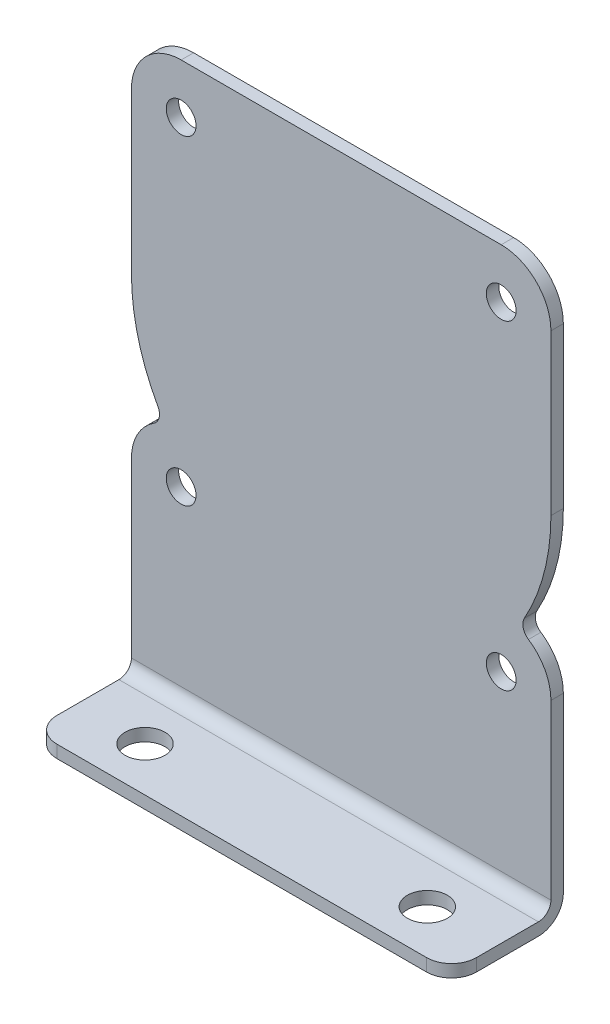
ISO-10303-21;
HEADER;
FILE_DESCRIPTION(('STEP AP214'),'2;1');
FILE_NAME('part.step','',(''),(''),'','','');
FILE_SCHEMA(('AUTOMOTIVE_DESIGN { 1 0 10303 214 1 1 1 1 }'));
ENDSEC;
DATA;
#1=APPLICATION_CONTEXT('core data for automotive mechanical design processes');
#2=APPLICATION_PROTOCOL_DEFINITION('international standard','automotive_design',2000,#1);
#3=PRODUCT_CONTEXT('',#1,'mechanical');
#4=PRODUCT('Part','Part','',(#3));
#5=PRODUCT_RELATED_PRODUCT_CATEGORY('part','',(#4));
#6=PRODUCT_DEFINITION_FORMATION('','',#4);
#7=PRODUCT_DEFINITION_CONTEXT('part definition',#1,'design');
#8=PRODUCT_DEFINITION('design','',#6,#7);
#9=PRODUCT_DEFINITION_SHAPE('','',#8);
#10=(LENGTH_UNIT() NAMED_UNIT(*) SI_UNIT(.MILLI.,.METRE.));
#11=(NAMED_UNIT(*) PLANE_ANGLE_UNIT() SI_UNIT($,.RADIAN.));
#12=(NAMED_UNIT(*) SI_UNIT($,.STERADIAN.) SOLID_ANGLE_UNIT());
#13=UNCERTAINTY_MEASURE_WITH_UNIT(LENGTH_MEASURE(1.E-05),#10,'distance_accuracy_value','');
#14=(GEOMETRIC_REPRESENTATION_CONTEXT(3) GLOBAL_UNCERTAINTY_ASSIGNED_CONTEXT((#13)) GLOBAL_UNIT_ASSIGNED_CONTEXT((#10,
#11,#12)) REPRESENTATION_CONTEXT('',''));
#15=CARTESIAN_POINT('',(0.,0.,0.));
#16=DIRECTION('',(0.,0.,1.));
#17=DIRECTION('',(1.,0.,0.));
#18=AXIS2_PLACEMENT_3D('',#15,#16,#17);
#19=CARTESIAN_POINT('',(23.622,-4.12115,11.1125));
#20=DIRECTION('',(0.,-1.,0.));
#21=DIRECTION('',(0.,0.,-1.));
#22=AXIS2_PLACEMENT_3D('',#19,#20,#21);
#23=CYLINDRICAL_SURFACE('',#22,3.175);
#24=CARTESIAN_POINT('',(23.622,-39.1922,11.1125));
#25=DIRECTION('',(0.,-1.,0.));
#26=DIRECTION('',(0.,0.,-1.));
#27=AXIS2_PLACEMENT_3D('',#24,#25,#26);
#28=CIRCLE('',#27,3.175);
#29=CARTESIAN_POINT('',(23.622,-39.1922,14.2875));
#30=VERTEX_POINT('',#29);
#31=CARTESIAN_POINT('',(26.797,-39.1922,11.1125));
#32=VERTEX_POINT('',#31);
#33=EDGE_CURVE('E19',#30,#32,#28,.F.);
#34=ORIENTED_EDGE('',*,*,#33,.F.);
#35=DIRECTION('',(0.,1.,0.));
#36=VECTOR('',#35,1.);
#37=CARTESIAN_POINT('',(23.622,-39.9923,14.2875));
#38=LINE('',#37,#36);
#39=CARTESIAN_POINT('',(23.622,-40.7924,14.2875));
#40=VERTEX_POINT('',#39);
#41=EDGE_CURVE('E114',#40,#30,#38,.T.);
#42=ORIENTED_EDGE('',*,*,#41,.F.);
#43=CARTESIAN_POINT('',(23.622,-40.7924,11.1125));
#44=DIRECTION('',(0.,-1.,0.));
#45=DIRECTION('',(0.,0.,-1.));
#46=AXIS2_PLACEMENT_3D('',#43,#44,#45);
#47=CIRCLE('',#46,3.175);
#48=CARTESIAN_POINT('',(26.797,-40.7924,11.1125));
#49=VERTEX_POINT('',#48);
#50=EDGE_CURVE('E250',#49,#40,#47,.T.);
#51=ORIENTED_EDGE('',*,*,#50,.F.);
#52=DIRECTION('',(0.,-1.,0.));
#53=VECTOR('',#52,1.);
#54=CARTESIAN_POINT('',(26.797,-4.12115,11.1125));
#55=LINE('',#54,#53);
#56=EDGE_CURVE('E124',#49,#32,#55,.F.);
#57=ORIENTED_EDGE('',*,*,#56,.T.);
#58=EDGE_LOOP('',(#34,#42,#51,#57));
#59=FACE_BOUND('',#58,.T.);
#60=ADVANCED_FACE('F16',(#59),#23,.T.);
#61=CARTESIAN_POINT('',(0.,-39.9923,14.2875));
#62=DIRECTION('',(0.,0.,1.));
#63=DIRECTION('',(1.,0.,0.));
#64=AXIS2_PLACEMENT_3D('',#61,#62,#63);
#65=PLANE('',#64);
#66=DIRECTION('',(0.,1.,0.));
#67=VECTOR('',#66,1.);
#68=CARTESIAN_POINT('',(-23.622,-35.87115,14.2875));
#69=LINE('',#68,#67);
#70=CARTESIAN_POINT('',(-23.622,-40.7924,14.2875));
#71=VERTEX_POINT('',#70);
#72=CARTESIAN_POINT('',(-23.622,-39.1922,14.2875));
#73=VERTEX_POINT('',#72);
#74=EDGE_CURVE('E138',#71,#73,#69,.T.);
#75=ORIENTED_EDGE('',*,*,#74,.F.);
#76=DIRECTION('',(1.,0.,0.));
#77=VECTOR('',#76,1.);
#78=CARTESIAN_POINT('',(-26.797,-40.7924,14.2875));
#79=LINE('',#78,#77);
#80=EDGE_CURVE('E119',#40,#71,#79,.F.);
#81=ORIENTED_EDGE('',*,*,#80,.F.);
#82=ORIENTED_EDGE('',*,*,#41,.T.);
#83=DIRECTION('',(1.,0.,0.));
#84=VECTOR('',#83,1.);
#85=CARTESIAN_POINT('',(-26.797,-39.1922,14.2875));
#86=LINE('',#85,#84);
#87=EDGE_CURVE('E118',#73,#30,#86,.T.);
#88=ORIENTED_EDGE('',*,*,#87,.F.);
#89=EDGE_LOOP('',(#75,#81,#82,#88));
#90=FACE_BOUND('',#89,.T.);
#91=ADVANCED_FACE('F117',(#90),#65,.T.);
#92=CARTESIAN_POINT('',(-23.622,-35.87115,11.1125));
#93=DIRECTION('',(0.,1.,0.));
#94=DIRECTION('',(0.,0.,1.));
#95=AXIS2_PLACEMENT_3D('',#92,#93,#94);
#96=CYLINDRICAL_SURFACE('',#95,3.175);
#97=CARTESIAN_POINT('',(-23.622,-40.7924,11.1125));
#98=DIRECTION('',(0.,1.,0.));
#99=DIRECTION('',(0.,0.,1.));
#100=AXIS2_PLACEMENT_3D('',#97,#98,#99);
#101=CIRCLE('',#100,3.175);
#102=CARTESIAN_POINT('',(-26.797,-40.7924,11.1125));
#103=VERTEX_POINT('',#102);
#104=EDGE_CURVE('E247',#71,#103,#101,.F.);
#105=ORIENTED_EDGE('',*,*,#104,.F.);
#106=ORIENTED_EDGE('',*,*,#74,.T.);
#107=CARTESIAN_POINT('',(-23.622,-39.1922,11.1125));
#108=DIRECTION('',(0.,1.,0.));
#109=DIRECTION('',(0.,0.,1.));
#110=AXIS2_PLACEMENT_3D('',#107,#108,#109);
#111=CIRCLE('',#110,3.175);
#112=CARTESIAN_POINT('',(-26.797,-39.1922,11.1125));
#113=VERTEX_POINT('',#112);
#114=EDGE_CURVE('E134',#113,#73,#111,.T.);
#115=ORIENTED_EDGE('',*,*,#114,.F.);
#116=DIRECTION('',(0.,1.,0.));
#117=VECTOR('',#116,1.);
#118=CARTESIAN_POINT('',(-26.797,-35.87115,11.1125));
#119=LINE('',#118,#117);
#120=EDGE_CURVE('E123',#113,#103,#119,.F.);
#121=ORIENTED_EDGE('',*,*,#120,.T.);
#122=EDGE_LOOP('',(#105,#106,#115,#121));
#123=FACE_BOUND('',#122,.T.);
#124=ADVANCED_FACE('F264',(#123),#96,.T.);
#125=CARTESIAN_POINT('',(-18.034,-130.509500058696,8.61414178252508));
#126=DIRECTION('',(0.,-1.,0.));
#127=DIRECTION('',(0.,0.,-1.));
#128=AXIS2_PLACEMENT_3D('',#125,#126,#127);
#129=CYLINDRICAL_SURFACE('',#128,2.5527);
#130=CARTESIAN_POINT('',(-18.034,-39.1922,8.61414178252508));
#131=DIRECTION('',(0.,-1.,0.));
#132=DIRECTION('',(0.,0.,-1.));
#133=AXIS2_PLACEMENT_3D('',#130,#131,#132);
#134=CIRCLE('',#133,2.5527);
#135=CARTESIAN_POINT('',(-18.034,-39.1922,6.06144178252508));
#136=VERTEX_POINT('',#135);
#137=EDGE_CURVE('E135',#136,#136,#134,.T.);
#138=ORIENTED_EDGE('',*,*,#137,.F.);
#139=EDGE_LOOP('',(#138));
#140=FACE_BOUND('',#139,.T.);
#141=CARTESIAN_POINT('',(-18.034,-40.7924,8.61414178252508));
#142=DIRECTION('',(0.,-1.,0.));
#143=DIRECTION('',(0.,0.,-1.));
#144=AXIS2_PLACEMENT_3D('',#141,#142,#143);
#145=CIRCLE('',#144,2.5527);
#146=CARTESIAN_POINT('',(-18.034,-40.7924,6.06144178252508));
#147=VERTEX_POINT('',#146);
#148=EDGE_CURVE('E244',#147,#147,#145,.F.);
#149=ORIENTED_EDGE('',*,*,#148,.F.);
#150=EDGE_LOOP('',(#149));
#151=FACE_BOUND('',#150,.T.);
#152=ADVANCED_FACE('F260',(#140,#151),#129,.F.);
#153=CARTESIAN_POINT('',(18.034,-130.509500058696,8.61414178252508));
#154=DIRECTION('',(0.,1.,0.));
#155=DIRECTION('',(0.,0.,1.));
#156=AXIS2_PLACEMENT_3D('',#153,#154,#155);
#157=CYLINDRICAL_SURFACE('',#156,2.5527);
#158=CARTESIAN_POINT('',(18.034,-39.1922,8.61414178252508));
#159=DIRECTION('',(0.,1.,0.));
#160=DIRECTION('',(0.,0.,1.));
#161=AXIS2_PLACEMENT_3D('',#158,#159,#160);
#162=CIRCLE('',#161,2.5527);
#163=CARTESIAN_POINT('',(18.034,-39.1922,11.1668417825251));
#164=VERTEX_POINT('',#163);
#165=EDGE_CURVE('E253',#164,#164,#162,.F.);
#166=ORIENTED_EDGE('',*,*,#165,.F.);
#167=EDGE_LOOP('',(#166));
#168=FACE_BOUND('',#167,.T.);
#169=CARTESIAN_POINT('',(18.034,-40.7924,8.61414178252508));
#170=DIRECTION('',(0.,1.,0.));
#171=DIRECTION('',(0.,0.,1.));
#172=AXIS2_PLACEMENT_3D('',#169,#170,#171);
#173=CIRCLE('',#172,2.5527);
#174=CARTESIAN_POINT('',(18.034,-40.7924,11.1668417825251));
#175=VERTEX_POINT('',#174);
#176=EDGE_CURVE('E240',#175,#175,#173,.T.);
#177=ORIENTED_EDGE('',*,*,#176,.F.);
#178=EDGE_LOOP('',(#177));
#179=FACE_BOUND('',#178,.T.);
#180=ADVANCED_FACE('F263',(#168,#179),#157,.F.);
#181=CARTESIAN_POINT('',(-26.797,-39.1922,1.5875));
#182=DIRECTION('',(0.,1.,0.));
#183=DIRECTION('',(0.,0.,1.));
#184=AXIS2_PLACEMENT_3D('',#181,#182,#183);
#185=PLANE('',#184);
#186=ORIENTED_EDGE('',*,*,#165,.T.);
#187=EDGE_LOOP('',(#186));
#188=FACE_BOUND('',#187,.T.);
#189=ORIENTED_EDGE('',*,*,#137,.T.);
#190=EDGE_LOOP('',(#189));
#191=FACE_BOUND('',#190,.T.);
#192=ORIENTED_EDGE('',*,*,#114,.T.);
#193=ORIENTED_EDGE('',*,*,#87,.T.);
#194=ORIENTED_EDGE('',*,*,#33,.T.);
#195=DIRECTION('',(0.,0.,-1.));
#196=VECTOR('',#195,1.);
#197=CARTESIAN_POINT('',(26.797,-39.1922,0.));
#198=LINE('',#197,#196);
#199=CARTESIAN_POINT('',(26.797,-39.1922,3.1877));
#200=VERTEX_POINT('',#199);
#201=EDGE_CURVE('E235',#200,#32,#198,.F.);
#202=ORIENTED_EDGE('',*,*,#201,.F.);
#203=DIRECTION('',(1.,0.,0.));
#204=VECTOR('',#203,1.);
#205=CARTESIAN_POINT('',(-13.3985,-39.1922,3.1877));
#206=LINE('',#205,#204);
#207=CARTESIAN_POINT('',(-26.797,-39.1922,3.1877));
#208=VERTEX_POINT('',#207);
#209=EDGE_CURVE('E252',#200,#208,#206,.F.);
#210=ORIENTED_EDGE('',*,*,#209,.T.);
#211=DIRECTION('',(0.,0.,1.));
#212=VECTOR('',#211,1.);
#213=CARTESIAN_POINT('',(-26.797,-39.1922,0.));
#214=LINE('',#213,#212);
#215=EDGE_CURVE('E205',#113,#208,#214,.F.);
#216=ORIENTED_EDGE('',*,*,#215,.F.);
#217=EDGE_LOOP('',(#192,#193,#194,#202,#210,#216));
#218=FACE_BOUND('',#217,.T.);
#219=ADVANCED_FACE('F129',(#188,#191,#218),#185,.T.);
#220=CARTESIAN_POINT('',(-13.3985,-37.592,3.1877));
#221=DIRECTION('',(1.,0.,0.));
#222=DIRECTION('',(0.,0.,-1.));
#223=AXIS2_PLACEMENT_3D('',#220,#221,#222);
#224=CYLINDRICAL_SURFACE('',#223,1.6002);
#225=ORIENTED_EDGE('',*,*,#209,.F.);
#226=CARTESIAN_POINT('',(26.797,-37.592,3.1877));
#227=DIRECTION('',(1.,0.,0.));
#228=DIRECTION('',(0.,0.,-1.));
#229=AXIS2_PLACEMENT_3D('',#226,#227,#228);
#230=CIRCLE('',#229,1.6002);
#231=CARTESIAN_POINT('',(26.797,-37.592,1.5875));
#232=VERTEX_POINT('',#231);
#233=EDGE_CURVE('E236',#232,#200,#230,.F.);
#234=ORIENTED_EDGE('',*,*,#233,.F.);
#235=DIRECTION('',(1.,0.,0.));
#236=VECTOR('',#235,1.);
#237=CARTESIAN_POINT('',(0.,-37.592,1.5875));
#238=LINE('',#237,#236);
#239=CARTESIAN_POINT('',(-26.797,-37.592,1.5875));
#240=VERTEX_POINT('',#239);
#241=EDGE_CURVE('E243',#240,#232,#238,.T.);
#242=ORIENTED_EDGE('',*,*,#241,.F.);
#243=CARTESIAN_POINT('',(-26.797,-37.592,3.1877));
#244=DIRECTION('',(1.,0.,0.));
#245=DIRECTION('',(0.,0.,-1.));
#246=AXIS2_PLACEMENT_3D('',#243,#244,#245);
#247=CIRCLE('',#246,1.6002);
#248=EDGE_CURVE('E202',#208,#240,#247,.T.);
#249=ORIENTED_EDGE('',*,*,#248,.F.);
#250=EDGE_LOOP('',(#225,#234,#242,#249));
#251=FACE_BOUND('',#250,.T.);
#252=ADVANCED_FACE('F272',(#251),#224,.F.);
#253=CARTESIAN_POINT('',(-26.797,-40.7924,1.5875));
#254=DIRECTION('',(0.,-1.,0.));
#255=DIRECTION('',(0.,0.,-1.));
#256=AXIS2_PLACEMENT_3D('',#253,#254,#255);
#257=PLANE('',#256);
#258=ORIENTED_EDGE('',*,*,#176,.T.);
#259=EDGE_LOOP('',(#258));
#260=FACE_BOUND('',#259,.T.);
#261=ORIENTED_EDGE('',*,*,#148,.T.);
#262=EDGE_LOOP('',(#261));
#263=FACE_BOUND('',#262,.T.);
#264=DIRECTION('',(-1.,0.,0.));
#265=VECTOR('',#264,1.);
#266=CARTESIAN_POINT('',(-13.3985,-40.7924,3.175));
#267=LINE('',#266,#265);
#268=CARTESIAN_POINT('',(26.797,-40.7924,3.175));
#269=VERTEX_POINT('',#268);
#270=CARTESIAN_POINT('',(-26.797,-40.7924,3.175));
#271=VERTEX_POINT('',#270);
#272=EDGE_CURVE('E196',#269,#271,#267,.T.);
#273=ORIENTED_EDGE('',*,*,#272,.F.);
#274=DIRECTION('',(0.,0.,-1.));
#275=VECTOR('',#274,1.);
#276=CARTESIAN_POINT('',(26.797,-40.7924,0.));
#277=LINE('',#276,#275);
#278=EDGE_CURVE('E280',#49,#269,#277,.T.);
#279=ORIENTED_EDGE('',*,*,#278,.F.);
#280=ORIENTED_EDGE('',*,*,#50,.T.);
#281=ORIENTED_EDGE('',*,*,#80,.T.);
#282=ORIENTED_EDGE('',*,*,#104,.T.);
#283=DIRECTION('',(0.,0.,1.));
#284=VECTOR('',#283,1.);
#285=CARTESIAN_POINT('',(-26.797,-40.7924,0.));
#286=LINE('',#285,#284);
#287=EDGE_CURVE('E201',#271,#103,#286,.T.);
#288=ORIENTED_EDGE('',*,*,#287,.F.);
#289=EDGE_LOOP('',(#273,#279,#280,#281,#282,#288));
#290=FACE_BOUND('',#289,.T.);
#291=ADVANCED_FACE('F268',(#260,#263,#290),#257,.T.);
#292=CARTESIAN_POINT('',(0.,0.,1.5875));
#293=DIRECTION('',(0.,0.,1.));
#294=DIRECTION('',(1.,0.,0.));
#295=AXIS2_PLACEMENT_3D('',#292,#293,#294);
#296=PLANE('',#295);
#297=CARTESIAN_POINT('',(-20.447,25.4,1.58750000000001));
#298=DIRECTION('',(0.,0.,1.));
#299=DIRECTION('',(1.,0.,0.));
#300=AXIS2_PLACEMENT_3D('',#297,#298,#299);
#301=CIRCLE('',#300,1.905);
#302=CARTESIAN_POINT('',(-18.542,25.4,1.58750000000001));
#303=VERTEX_POINT('',#302);
#304=EDGE_CURVE('E193',#303,#303,#301,.F.);
#305=ORIENTED_EDGE('',*,*,#304,.T.);
#306=EDGE_LOOP('',(#305));
#307=FACE_BOUND('',#306,.T.);
#308=CARTESIAN_POINT('',(20.447,25.4,1.58750000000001));
#309=DIRECTION('',(0.,0.,1.));
#310=DIRECTION('',(1.,0.,0.));
#311=AXIS2_PLACEMENT_3D('',#308,#309,#310);
#312=CIRCLE('',#311,1.905);
#313=CARTESIAN_POINT('',(22.352,25.4,1.58750000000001));
#314=VERTEX_POINT('',#313);
#315=EDGE_CURVE('E190',#314,#314,#312,.F.);
#316=ORIENTED_EDGE('',*,*,#315,.T.);
#317=EDGE_LOOP('',(#316));
#318=FACE_BOUND('',#317,.T.);
#319=CARTESIAN_POINT('',(20.447,-15.4939999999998,1.58750000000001));
#320=DIRECTION('',(0.,0.,1.));
#321=DIRECTION('',(1.,0.,0.));
#322=AXIS2_PLACEMENT_3D('',#319,#320,#321);
#323=CIRCLE('',#322,1.905);
#324=CARTESIAN_POINT('',(22.352,-15.4939999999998,1.58750000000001));
#325=VERTEX_POINT('',#324);
#326=EDGE_CURVE('E187',#325,#325,#323,.F.);
#327=ORIENTED_EDGE('',*,*,#326,.T.);
#328=EDGE_LOOP('',(#327));
#329=FACE_BOUND('',#328,.T.);
#330=CARTESIAN_POINT('',(-20.447,-15.4939999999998,1.58750000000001));
#331=DIRECTION('',(0.,0.,1.));
#332=DIRECTION('',(1.,0.,0.));
#333=AXIS2_PLACEMENT_3D('',#330,#331,#332);
#334=CIRCLE('',#333,1.905);
#335=CARTESIAN_POINT('',(-18.542,-15.4939999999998,1.58750000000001));
#336=VERTEX_POINT('',#335);
#337=EDGE_CURVE('E184',#336,#336,#334,.F.);
#338=ORIENTED_EDGE('',*,*,#337,.T.);
#339=EDGE_LOOP('',(#338));
#340=FACE_BOUND('',#339,.T.);
#341=CARTESIAN_POINT('',(-20.447,-15.4939999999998,1.5875));
#342=DIRECTION('',(0.,0.,-1.));
#343=DIRECTION('',(-1.,0.,0.));
#344=AXIS2_PLACEMENT_3D('',#341,#342,#343);
#345=CIRCLE('',#344,6.34999999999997);
#346=CARTESIAN_POINT('',(-26.797,-15.4939999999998,1.5875));
#347=VERTEX_POINT('',#346);
#348=CARTESIAN_POINT('',(-23.9286348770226,-10.1835651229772,1.5875));
#349=VERTEX_POINT('',#348);
#350=EDGE_CURVE('E206',#347,#349,#345,.T.);
#351=ORIENTED_EDGE('',*,*,#350,.F.);
#352=DIRECTION('',(0.,1.,0.));
#353=VECTOR('',#352,1.);
#354=CARTESIAN_POINT('',(-26.797,-31.75,1.5875));
#355=LINE('',#354,#353);
#356=EDGE_CURVE('E204',#240,#347,#355,.T.);
#357=ORIENTED_EDGE('',*,*,#356,.F.);
#358=ORIENTED_EDGE('',*,*,#241,.T.);
#359=DIRECTION('',(0.,1.,0.));
#360=VECTOR('',#359,1.);
#361=CARTESIAN_POINT('',(26.797,31.75,1.5875));
#362=LINE('',#361,#360);
#363=CARTESIAN_POINT('',(26.797,-15.4939999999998,1.5875));
#364=VERTEX_POINT('',#363);
#365=EDGE_CURVE('E239',#364,#232,#362,.F.);
#366=ORIENTED_EDGE('',*,*,#365,.F.);
#367=CARTESIAN_POINT('',(20.447,-15.4939999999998,1.5875));
#368=DIRECTION('',(0.,0.,-1.));
#369=DIRECTION('',(-1.,0.,0.));
#370=AXIS2_PLACEMENT_3D('',#367,#368,#369);
#371=CIRCLE('',#370,6.34999999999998);
#372=CARTESIAN_POINT('',(23.9286348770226,-10.1835651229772,1.5875));
#373=VERTEX_POINT('',#372);
#374=EDGE_CURVE('E232',#373,#364,#371,.T.);
#375=ORIENTED_EDGE('',*,*,#374,.F.);
#376=CARTESIAN_POINT('',(24.7990435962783,-8.85595640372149,1.5875));
#377=DIRECTION('',(0.,0.,-1.));
#378=DIRECTION('',(-1.,0.,0.));
#379=AXIS2_PLACEMENT_3D('',#376,#377,#378);
#380=CIRCLE('',#379,1.5875);
#381=CARTESIAN_POINT('',(23.4120724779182,-8.0836434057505,1.5875));
#382=VERTEX_POINT('',#381);
#383=EDGE_CURVE('E228',#373,#382,#380,.T.);
#384=ORIENTED_EDGE('',*,*,#383,.T.);
#385=CARTESIAN_POINT('',(0.,4.95300000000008,1.5875));
#386=DIRECTION('',(0.,0.,-1.));
#387=DIRECTION('',(-1.,0.,0.));
#388=AXIS2_PLACEMENT_3D('',#385,#386,#387);
#389=CIRCLE('',#388,26.7969999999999);
#390=CARTESIAN_POINT('',(26.797,4.95300000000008,1.5875));
#391=VERTEX_POINT('',#390);
#392=EDGE_CURVE('E225',#391,#382,#389,.T.);
#393=ORIENTED_EDGE('',*,*,#392,.F.);
#394=DIRECTION('',(0.,1.,0.));
#395=VECTOR('',#394,1.);
#396=CARTESIAN_POINT('',(26.797,31.75,1.5875));
#397=LINE('',#396,#395);
#398=CARTESIAN_POINT('',(26.797,25.4,1.5875));
#399=VERTEX_POINT('',#398);
#400=EDGE_CURVE('E224',#399,#391,#397,.F.);
#401=ORIENTED_EDGE('',*,*,#400,.F.);
#402=CARTESIAN_POINT('',(20.447,25.4,1.5875));
#403=DIRECTION('',(0.,0.,-1.));
#404=DIRECTION('',(-1.,0.,0.));
#405=AXIS2_PLACEMENT_3D('',#402,#403,#404);
#406=CIRCLE('',#405,6.34999999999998);
#407=CARTESIAN_POINT('',(20.447,31.75,1.5875));
#408=VERTEX_POINT('',#407);
#409=EDGE_CURVE('E221',#408,#399,#406,.T.);
#410=ORIENTED_EDGE('',*,*,#409,.F.);
#411=DIRECTION('',(1.,0.,0.));
#412=VECTOR('',#411,1.);
#413=CARTESIAN_POINT('',(-26.797,31.75,1.5875));
#414=LINE('',#413,#412);
#415=CARTESIAN_POINT('',(-20.447,31.75,1.5875));
#416=VERTEX_POINT('',#415);
#417=EDGE_CURVE('E292',#416,#408,#414,.T.);
#418=ORIENTED_EDGE('',*,*,#417,.F.);
#419=CARTESIAN_POINT('',(-20.447,25.4,1.5875));
#420=DIRECTION('',(0.,0.,-1.));
#421=DIRECTION('',(-1.,0.,0.));
#422=AXIS2_PLACEMENT_3D('',#419,#420,#421);
#423=CIRCLE('',#422,6.34999999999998);
#424=CARTESIAN_POINT('',(-26.797,25.4,1.5875));
#425=VERTEX_POINT('',#424);
#426=EDGE_CURVE('E217',#425,#416,#423,.T.);
#427=ORIENTED_EDGE('',*,*,#426,.F.);
#428=DIRECTION('',(0.,1.,0.));
#429=VECTOR('',#428,1.);
#430=CARTESIAN_POINT('',(-26.797,-31.75,1.5875));
#431=LINE('',#430,#429);
#432=CARTESIAN_POINT('',(-26.797,4.95300000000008,1.5875));
#433=VERTEX_POINT('',#432);
#434=EDGE_CURVE('E290',#433,#425,#431,.T.);
#435=ORIENTED_EDGE('',*,*,#434,.F.);
#436=CARTESIAN_POINT('',(0.,4.95300000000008,1.5875));
#437=DIRECTION('',(0.,0.,-1.));
#438=DIRECTION('',(-1.,0.,0.));
#439=AXIS2_PLACEMENT_3D('',#436,#437,#438);
#440=CIRCLE('',#439,26.7969999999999);
#441=CARTESIAN_POINT('',(-23.4120724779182,-8.08364340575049,1.5875));
#442=VERTEX_POINT('',#441);
#443=EDGE_CURVE('E213',#442,#433,#440,.T.);
#444=ORIENTED_EDGE('',*,*,#443,.F.);
#445=CARTESIAN_POINT('',(-24.7990435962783,-8.85595640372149,1.5875));
#446=DIRECTION('',(0.,0.,-1.));
#447=DIRECTION('',(-1.,0.,0.));
#448=AXIS2_PLACEMENT_3D('',#445,#446,#447);
#449=CIRCLE('',#448,1.5875);
#450=EDGE_CURVE('E209',#442,#349,#449,.T.);
#451=ORIENTED_EDGE('',*,*,#450,.T.);
#452=EDGE_LOOP('',(#351,#357,#358,#366,#375,#384,#393,#401,#410,#418,#427,#435,#444,#451));
#453=FACE_BOUND('',#452,.T.);
#454=ADVANCED_FACE('F271',(#307,#318,#329,#340,#453),#296,.T.);
#455=CARTESIAN_POINT('',(26.797,31.75,0.));
#456=DIRECTION('',(1.,0.,0.));
#457=DIRECTION('',(0.,0.,-1.));
#458=AXIS2_PLACEMENT_3D('',#455,#456,#457);
#459=PLANE('',#458);
#460=ORIENTED_EDGE('',*,*,#233,.T.);
#461=ORIENTED_EDGE('',*,*,#201,.T.);
#462=ORIENTED_EDGE('',*,*,#56,.F.);
#463=ORIENTED_EDGE('',*,*,#278,.T.);
#464=CARTESIAN_POINT('',(26.797,-37.6174,3.175));
#465=DIRECTION('',(-1.,0.,0.));
#466=DIRECTION('',(0.,0.,1.));
#467=AXIS2_PLACEMENT_3D('',#464,#465,#466);
#468=CIRCLE('',#467,3.175);
#469=CARTESIAN_POINT('',(26.797,-37.6174,0.));
#470=VERTEX_POINT('',#469);
#471=EDGE_CURVE('E197',#470,#269,#468,.T.);
#472=ORIENTED_EDGE('',*,*,#471,.F.);
#473=DIRECTION('',(0.,1.,0.));
#474=VECTOR('',#473,1.);
#475=CARTESIAN_POINT('',(26.797,0.,0.));
#476=LINE('',#475,#474);
#477=CARTESIAN_POINT('',(26.797,-15.4939999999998,0.));
#478=VERTEX_POINT('',#477);
#479=EDGE_CURVE('E183',#470,#478,#476,.T.);
#480=ORIENTED_EDGE('',*,*,#479,.T.);
#481=DIRECTION('',(0.,0.,-1.));
#482=VECTOR('',#481,1.);
#483=CARTESIAN_POINT('',(26.7969999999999,-15.4939999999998,1.5875));
#484=LINE('',#483,#482);
#485=EDGE_CURVE('E234',#364,#478,#484,.T.);
#486=ORIENTED_EDGE('',*,*,#485,.F.);
#487=ORIENTED_EDGE('',*,*,#365,.T.);
#488=EDGE_LOOP('',(#460,#461,#462,#463,#472,#480,#486,#487));
#489=FACE_BOUND('',#488,.T.);
#490=ADVANCED_FACE('F317',(#489),#459,.T.);
#491=CARTESIAN_POINT('',(20.447,-15.4939999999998,1.5875));
#492=DIRECTION('',(0.,0.,-1.));
#493=DIRECTION('',(-1.,0.,0.));
#494=AXIS2_PLACEMENT_3D('',#491,#492,#493);
#495=CYLINDRICAL_SURFACE('',#494,6.34999999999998);
#496=ORIENTED_EDGE('',*,*,#374,.T.);
#497=ORIENTED_EDGE('',*,*,#485,.T.);
#498=CARTESIAN_POINT('',(20.447,-15.4939999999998,0.));
#499=DIRECTION('',(0.,0.,-1.));
#500=DIRECTION('',(-1.,0.,0.));
#501=AXIS2_PLACEMENT_3D('',#498,#499,#500);
#502=CIRCLE('',#501,6.34999999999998);
#503=CARTESIAN_POINT('',(23.9286348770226,-10.1835651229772,0.));
#504=VERTEX_POINT('',#503);
#505=EDGE_CURVE('E180',#478,#504,#502,.F.);
#506=ORIENTED_EDGE('',*,*,#505,.T.);
#507=DIRECTION('',(0.,0.,-1.));
#508=VECTOR('',#507,1.);
#509=CARTESIAN_POINT('',(23.9286348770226,-10.1835651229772,1.5875));
#510=LINE('',#509,#508);
#511=EDGE_CURVE('E231',#504,#373,#510,.F.);
#512=ORIENTED_EDGE('',*,*,#511,.T.);
#513=EDGE_LOOP('',(#496,#497,#506,#512));
#514=FACE_BOUND('',#513,.T.);
#515=ADVANCED_FACE('F424',(#514),#495,.T.);
#516=CARTESIAN_POINT('',(24.7990435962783,-8.85595640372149,1.5875));
#517=DIRECTION('',(0.,0.,-1.));
#518=DIRECTION('',(-1.,0.,0.));
#519=AXIS2_PLACEMENT_3D('',#516,#517,#518);
#520=CYLINDRICAL_SURFACE('',#519,1.5875);
#521=DIRECTION('',(0.,0.,-1.));
#522=VECTOR('',#521,1.);
#523=CARTESIAN_POINT('',(23.4120724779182,-8.0836434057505,1.5875));
#524=LINE('',#523,#522);
#525=CARTESIAN_POINT('',(23.4120724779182,-8.0836434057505,0.));
#526=VERTEX_POINT('',#525);
#527=EDGE_CURVE('E227',#382,#526,#524,.T.);
#528=ORIENTED_EDGE('',*,*,#527,.F.);
#529=ORIENTED_EDGE('',*,*,#383,.F.);
#530=ORIENTED_EDGE('',*,*,#511,.F.);
#531=CARTESIAN_POINT('',(24.7990435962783,-8.85595640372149,0.));
#532=DIRECTION('',(0.,0.,-1.));
#533=DIRECTION('',(-1.,0.,0.));
#534=AXIS2_PLACEMENT_3D('',#531,#532,#533);
#535=CIRCLE('',#534,1.5875);
#536=EDGE_CURVE('E177',#504,#526,#535,.T.);
#537=ORIENTED_EDGE('',*,*,#536,.T.);
#538=EDGE_LOOP('',(#528,#529,#530,#537));
#539=FACE_BOUND('',#538,.T.);
#540=ADVANCED_FACE('F421',(#539),#520,.F.);
#541=CARTESIAN_POINT('',(0.,4.95300000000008,1.5875));
#542=DIRECTION('',(0.,0.,-1.));
#543=DIRECTION('',(-1.,0.,0.));
#544=AXIS2_PLACEMENT_3D('',#541,#542,#543);
#545=CYLINDRICAL_SURFACE('',#544,26.7969999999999);
#546=ORIENTED_EDGE('',*,*,#392,.T.);
#547=ORIENTED_EDGE('',*,*,#527,.T.);
#548=CARTESIAN_POINT('',(0.,4.95300000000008,0.));
#549=DIRECTION('',(0.,0.,-1.));
#550=DIRECTION('',(-1.,0.,0.));
#551=AXIS2_PLACEMENT_3D('',#548,#549,#550);
#552=CIRCLE('',#551,26.7969999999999);
#553=CARTESIAN_POINT('',(26.797,4.95300000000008,0.));
#554=VERTEX_POINT('',#553);
#555=EDGE_CURVE('E174',#526,#554,#552,.F.);
#556=ORIENTED_EDGE('',*,*,#555,.T.);
#557=DIRECTION('',(0.,0.,-1.));
#558=VECTOR('',#557,1.);
#559=CARTESIAN_POINT('',(26.797,4.95300000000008,0.));
#560=LINE('',#559,#558);
#561=EDGE_CURVE('E294',#391,#554,#560,.T.);
#562=ORIENTED_EDGE('',*,*,#561,.F.);
#563=EDGE_LOOP('',(#546,#547,#556,#562));
#564=FACE_BOUND('',#563,.T.);
#565=ADVANCED_FACE('F427',(#564),#545,.T.);
#566=CARTESIAN_POINT('',(26.797,31.75,0.));
#567=DIRECTION('',(1.,0.,0.));
#568=DIRECTION('',(0.,0.,-1.));
#569=AXIS2_PLACEMENT_3D('',#566,#567,#568);
#570=PLANE('',#569);
#571=DIRECTION('',(0.,0.,-1.));
#572=VECTOR('',#571,1.);
#573=CARTESIAN_POINT('',(26.7969999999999,25.4,1.5875));
#574=LINE('',#573,#572);
#575=CARTESIAN_POINT('',(26.7969999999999,25.4,0.));
#576=VERTEX_POINT('',#575);
#577=EDGE_CURVE('E223',#399,#576,#574,.T.);
#578=ORIENTED_EDGE('',*,*,#577,.F.);
#579=ORIENTED_EDGE('',*,*,#400,.T.);
#580=ORIENTED_EDGE('',*,*,#561,.T.);
#581=DIRECTION('',(0.,1.,0.));
#582=VECTOR('',#581,1.);
#583=CARTESIAN_POINT('',(26.797,0.,0.));
#584=LINE('',#583,#582);
#585=EDGE_CURVE('E173',#554,#576,#584,.T.);
#586=ORIENTED_EDGE('',*,*,#585,.T.);
#587=EDGE_LOOP('',(#578,#579,#580,#586));
#588=FACE_BOUND('',#587,.T.);
#589=ADVANCED_FACE('F363',(#588),#570,.T.);
#590=CARTESIAN_POINT('',(20.447,25.4,1.5875));
#591=DIRECTION('',(0.,0.,-1.));
#592=DIRECTION('',(-1.,0.,0.));
#593=AXIS2_PLACEMENT_3D('',#590,#591,#592);
#594=CYLINDRICAL_SURFACE('',#593,6.34999999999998);
#595=ORIENTED_EDGE('',*,*,#409,.T.);
#596=ORIENTED_EDGE('',*,*,#577,.T.);
#597=CARTESIAN_POINT('',(20.447,25.4,0.));
#598=DIRECTION('',(0.,0.,-1.));
#599=DIRECTION('',(-1.,0.,0.));
#600=AXIS2_PLACEMENT_3D('',#597,#598,#599);
#601=CIRCLE('',#600,6.34999999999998);
#602=CARTESIAN_POINT('',(20.447,31.75,0.));
#603=VERTEX_POINT('',#602);
#604=EDGE_CURVE('E170',#576,#603,#601,.F.);
#605=ORIENTED_EDGE('',*,*,#604,.T.);
#606=DIRECTION('',(0.,0.,1.));
#607=VECTOR('',#606,1.);
#608=CARTESIAN_POINT('',(20.447,31.75,0.));
#609=LINE('',#608,#607);
#610=EDGE_CURVE('E220',#408,#603,#609,.F.);
#611=ORIENTED_EDGE('',*,*,#610,.F.);
#612=EDGE_LOOP('',(#595,#596,#605,#611));
#613=FACE_BOUND('',#612,.T.);
#614=ADVANCED_FACE('F361',(#613),#594,.T.);
#615=CARTESIAN_POINT('',(-26.797,31.75,0.));
#616=DIRECTION('',(0.,1.,0.));
#617=DIRECTION('',(0.,0.,1.));
#618=AXIS2_PLACEMENT_3D('',#615,#616,#617);
#619=PLANE('',#618);
#620=ORIENTED_EDGE('',*,*,#610,.T.);
#621=DIRECTION('',(1.,0.,0.));
#622=VECTOR('',#621,1.);
#623=CARTESIAN_POINT('',(0.,31.75,0.));
#624=LINE('',#623,#622);
#625=CARTESIAN_POINT('',(-20.447,31.75,0.));
#626=VERTEX_POINT('',#625);
#627=EDGE_CURVE('E169',#603,#626,#624,.F.);
#628=ORIENTED_EDGE('',*,*,#627,.T.);
#629=DIRECTION('',(0.,0.,-1.));
#630=VECTOR('',#629,1.);
#631=CARTESIAN_POINT('',(-20.447,31.75,1.5875));
#632=LINE('',#631,#630);
#633=EDGE_CURVE('E219',#416,#626,#632,.T.);
#634=ORIENTED_EDGE('',*,*,#633,.F.);
#635=ORIENTED_EDGE('',*,*,#417,.T.);
#636=EDGE_LOOP('',(#620,#628,#634,#635));
#637=FACE_BOUND('',#636,.T.);
#638=ADVANCED_FACE('F347',(#637),#619,.T.);
#639=CARTESIAN_POINT('',(-20.447,25.4,1.5875));
#640=DIRECTION('',(0.,0.,-1.));
#641=DIRECTION('',(-1.,0.,0.));
#642=AXIS2_PLACEMENT_3D('',#639,#640,#641);
#643=CYLINDRICAL_SURFACE('',#642,6.34999999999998);
#644=ORIENTED_EDGE('',*,*,#426,.T.);
#645=ORIENTED_EDGE('',*,*,#633,.T.);
#646=CARTESIAN_POINT('',(-20.447,25.4,0.));
#647=DIRECTION('',(0.,0.,-1.));
#648=DIRECTION('',(-1.,0.,0.));
#649=AXIS2_PLACEMENT_3D('',#646,#647,#648);
#650=CIRCLE('',#649,6.34999999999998);
#651=CARTESIAN_POINT('',(-26.797,25.4,0.));
#652=VERTEX_POINT('',#651);
#653=EDGE_CURVE('E166',#626,#652,#650,.F.);
#654=ORIENTED_EDGE('',*,*,#653,.T.);
#655=DIRECTION('',(0.,0.,1.));
#656=VECTOR('',#655,1.);
#657=CARTESIAN_POINT('',(-26.797,25.4,0.));
#658=LINE('',#657,#656);
#659=EDGE_CURVE('E216',#425,#652,#658,.F.);
#660=ORIENTED_EDGE('',*,*,#659,.F.);
#661=EDGE_LOOP('',(#644,#645,#654,#660));
#662=FACE_BOUND('',#661,.T.);
#663=ADVANCED_FACE('F408',(#662),#643,.T.);
#664=CARTESIAN_POINT('',(-26.797,-31.75,0.));
#665=DIRECTION('',(-1.,0.,0.));
#666=DIRECTION('',(0.,0.,1.));
#667=AXIS2_PLACEMENT_3D('',#664,#665,#666);
#668=PLANE('',#667);
#669=ORIENTED_EDGE('',*,*,#659,.T.);
#670=DIRECTION('',(0.,1.,0.));
#671=VECTOR('',#670,1.);
#672=CARTESIAN_POINT('',(-26.797,0.,0.));
#673=LINE('',#672,#671);
#674=CARTESIAN_POINT('',(-26.797,4.95300000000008,0.));
#675=VERTEX_POINT('',#674);
#676=EDGE_CURVE('E165',#652,#675,#673,.F.);
#677=ORIENTED_EDGE('',*,*,#676,.T.);
#678=DIRECTION('',(0.,0.,-1.));
#679=VECTOR('',#678,1.);
#680=CARTESIAN_POINT('',(-26.7969999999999,4.95300000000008,1.5875));
#681=LINE('',#680,#679);
#682=EDGE_CURVE('E215',#433,#675,#681,.T.);
#683=ORIENTED_EDGE('',*,*,#682,.F.);
#684=ORIENTED_EDGE('',*,*,#434,.T.);
#685=EDGE_LOOP('',(#669,#677,#683,#684));
#686=FACE_BOUND('',#685,.T.);
#687=ADVANCED_FACE('F403',(#686),#668,.T.);
#688=CARTESIAN_POINT('',(0.,4.95300000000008,1.5875));
#689=DIRECTION('',(0.,0.,-1.));
#690=DIRECTION('',(-1.,0.,0.));
#691=AXIS2_PLACEMENT_3D('',#688,#689,#690);
#692=CYLINDRICAL_SURFACE('',#691,26.7969999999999);
#693=ORIENTED_EDGE('',*,*,#443,.T.);
#694=ORIENTED_EDGE('',*,*,#682,.T.);
#695=CARTESIAN_POINT('',(0.,4.95300000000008,0.));
#696=DIRECTION('',(0.,0.,-1.));
#697=DIRECTION('',(-1.,0.,0.));
#698=AXIS2_PLACEMENT_3D('',#695,#696,#697);
#699=CIRCLE('',#698,26.7969999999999);
#700=CARTESIAN_POINT('',(-23.4120724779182,-8.08364340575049,0.));
#701=VERTEX_POINT('',#700);
#702=EDGE_CURVE('E162',#675,#701,#699,.F.);
#703=ORIENTED_EDGE('',*,*,#702,.T.);
#704=DIRECTION('',(0.,0.,-1.));
#705=VECTOR('',#704,1.);
#706=CARTESIAN_POINT('',(-23.4120724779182,-8.08364340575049,1.5875));
#707=LINE('',#706,#705);
#708=EDGE_CURVE('E212',#701,#442,#707,.F.);
#709=ORIENTED_EDGE('',*,*,#708,.T.);
#710=EDGE_LOOP('',(#693,#694,#703,#709));
#711=FACE_BOUND('',#710,.T.);
#712=ADVANCED_FACE('F397',(#711),#692,.T.);
#713=CARTESIAN_POINT('',(-24.7990435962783,-8.85595640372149,1.5875));
#714=DIRECTION('',(0.,0.,-1.));
#715=DIRECTION('',(-1.,0.,0.));
#716=AXIS2_PLACEMENT_3D('',#713,#714,#715);
#717=CYLINDRICAL_SURFACE('',#716,1.5875);
#718=DIRECTION('',(0.,0.,-1.));
#719=VECTOR('',#718,1.);
#720=CARTESIAN_POINT('',(-23.9286348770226,-10.1835651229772,1.5875));
#721=LINE('',#720,#719);
#722=CARTESIAN_POINT('',(-23.9286348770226,-10.1835651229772,0.));
#723=VERTEX_POINT('',#722);
#724=EDGE_CURVE('E208',#349,#723,#721,.T.);
#725=ORIENTED_EDGE('',*,*,#724,.F.);
#726=ORIENTED_EDGE('',*,*,#450,.F.);
#727=ORIENTED_EDGE('',*,*,#708,.F.);
#728=CARTESIAN_POINT('',(-24.7990435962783,-8.85595640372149,0.));
#729=DIRECTION('',(0.,0.,-1.));
#730=DIRECTION('',(-1.,0.,0.));
#731=AXIS2_PLACEMENT_3D('',#728,#729,#730);
#732=CIRCLE('',#731,1.5875);
#733=EDGE_CURVE('E159',#701,#723,#732,.T.);
#734=ORIENTED_EDGE('',*,*,#733,.T.);
#735=EDGE_LOOP('',(#725,#726,#727,#734));
#736=FACE_BOUND('',#735,.T.);
#737=ADVANCED_FACE('F390',(#736),#717,.F.);
#738=CARTESIAN_POINT('',(-20.447,-15.4939999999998,1.5875));
#739=DIRECTION('',(0.,0.,-1.));
#740=DIRECTION('',(-1.,0.,0.));
#741=AXIS2_PLACEMENT_3D('',#738,#739,#740);
#742=CYLINDRICAL_SURFACE('',#741,6.34999999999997);
#743=ORIENTED_EDGE('',*,*,#350,.T.);
#744=ORIENTED_EDGE('',*,*,#724,.T.);
#745=CARTESIAN_POINT('',(-20.447,-15.4939999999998,0.));
#746=DIRECTION('',(0.,0.,-1.));
#747=DIRECTION('',(-1.,0.,0.));
#748=AXIS2_PLACEMENT_3D('',#745,#746,#747);
#749=CIRCLE('',#748,6.34999999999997);
#750=CARTESIAN_POINT('',(-26.797,-15.4939999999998,0.));
#751=VERTEX_POINT('',#750);
#752=EDGE_CURVE('E155',#723,#751,#749,.F.);
#753=ORIENTED_EDGE('',*,*,#752,.T.);
#754=DIRECTION('',(0.,0.,1.));
#755=VECTOR('',#754,1.);
#756=CARTESIAN_POINT('',(-26.797,-15.4939999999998,0.));
#757=LINE('',#756,#755);
#758=EDGE_CURVE('E330',#347,#751,#757,.F.);
#759=ORIENTED_EDGE('',*,*,#758,.F.);
#760=EDGE_LOOP('',(#743,#744,#753,#759));
#761=FACE_BOUND('',#760,.T.);
#762=ADVANCED_FACE('F384',(#761),#742,.T.);
#763=CARTESIAN_POINT('',(-26.797,-31.75,0.));
#764=DIRECTION('',(-1.,0.,0.));
#765=DIRECTION('',(0.,0.,1.));
#766=AXIS2_PLACEMENT_3D('',#763,#764,#765);
#767=PLANE('',#766);
#768=CARTESIAN_POINT('',(-26.797,-37.6174,3.175));
#769=DIRECTION('',(-1.,0.,0.));
#770=DIRECTION('',(0.,0.,1.));
#771=AXIS2_PLACEMENT_3D('',#768,#769,#770);
#772=CIRCLE('',#771,3.175);
#773=CARTESIAN_POINT('',(-26.797,-37.6174,0.));
#774=VERTEX_POINT('',#773);
#775=EDGE_CURVE('E34',#271,#774,#772,.F.);
#776=ORIENTED_EDGE('',*,*,#775,.F.);
#777=ORIENTED_EDGE('',*,*,#287,.T.);
#778=ORIENTED_EDGE('',*,*,#120,.F.);
#779=ORIENTED_EDGE('',*,*,#215,.T.);
#780=ORIENTED_EDGE('',*,*,#248,.T.);
#781=ORIENTED_EDGE('',*,*,#356,.T.);
#782=ORIENTED_EDGE('',*,*,#758,.T.);
#783=DIRECTION('',(0.,1.,0.));
#784=VECTOR('',#783,1.);
#785=CARTESIAN_POINT('',(-26.7969999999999,0.,0.));
#786=LINE('',#785,#784);
#787=EDGE_CURVE('E158',#751,#774,#786,.F.);
#788=ORIENTED_EDGE('',*,*,#787,.T.);
#789=EDGE_LOOP('',(#776,#777,#778,#779,#780,#781,#782,#788));
#790=FACE_BOUND('',#789,.T.);
#791=ADVANCED_FACE('F371',(#790),#767,.T.);
#792=CARTESIAN_POINT('',(-13.3985,-37.6174,3.175));
#793=DIRECTION('',(-1.,0.,0.));
#794=DIRECTION('',(0.,0.,1.));
#795=AXIS2_PLACEMENT_3D('',#792,#793,#794);
#796=CYLINDRICAL_SURFACE('',#795,3.175);
#797=ORIENTED_EDGE('',*,*,#471,.T.);
#798=ORIENTED_EDGE('',*,*,#272,.T.);
#799=ORIENTED_EDGE('',*,*,#775,.T.);
#800=DIRECTION('',(1.,0.,0.));
#801=VECTOR('',#800,1.);
#802=CARTESIAN_POINT('',(0.,-37.6174,0.));
#803=LINE('',#802,#801);
#804=EDGE_CURVE('E154',#774,#470,#803,.T.);
#805=ORIENTED_EDGE('',*,*,#804,.T.);
#806=EDGE_LOOP('',(#797,#798,#799,#805));
#807=FACE_BOUND('',#806,.T.);
#808=ADVANCED_FACE('F319',(#807),#796,.T.);
#809=CARTESIAN_POINT('',(-20.447,25.4,-89.7298000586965));
#810=DIRECTION('',(0.,0.,1.));
#811=DIRECTION('',(1.,0.,0.));
#812=AXIS2_PLACEMENT_3D('',#809,#810,#811);
#813=CYLINDRICAL_SURFACE('',#812,1.905);
#814=ORIENTED_EDGE('',*,*,#304,.F.);
#815=EDGE_LOOP('',(#814));
#816=FACE_BOUND('',#815,.T.);
#817=CARTESIAN_POINT('',(-20.447,25.4,0.));
#818=DIRECTION('',(0.,0.,1.));
#819=DIRECTION('',(1.,0.,0.));
#820=AXIS2_PLACEMENT_3D('',#817,#818,#819);
#821=CIRCLE('',#820,1.905);
#822=CARTESIAN_POINT('',(-18.542,25.4,0.));
#823=VERTEX_POINT('',#822);
#824=EDGE_CURVE('E151',#823,#823,#821,.F.);
#825=ORIENTED_EDGE('',*,*,#824,.T.);
#826=EDGE_LOOP('',(#825));
#827=FACE_BOUND('',#826,.T.);
#828=ADVANCED_FACE('F456',(#816,#827),#813,.F.);
#829=CARTESIAN_POINT('',(20.447,25.4,-89.7298000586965));
#830=DIRECTION('',(0.,0.,1.));
#831=DIRECTION('',(1.,0.,0.));
#832=AXIS2_PLACEMENT_3D('',#829,#830,#831);
#833=CYLINDRICAL_SURFACE('',#832,1.905);
#834=ORIENTED_EDGE('',*,*,#315,.F.);
#835=EDGE_LOOP('',(#834));
#836=FACE_BOUND('',#835,.T.);
#837=CARTESIAN_POINT('',(20.447,25.4,0.));
#838=DIRECTION('',(0.,0.,1.));
#839=DIRECTION('',(1.,0.,0.));
#840=AXIS2_PLACEMENT_3D('',#837,#838,#839);
#841=CIRCLE('',#840,1.905);
#842=CARTESIAN_POINT('',(22.352,25.4,0.));
#843=VERTEX_POINT('',#842);
#844=EDGE_CURVE('E148',#843,#843,#841,.F.);
#845=ORIENTED_EDGE('',*,*,#844,.T.);
#846=EDGE_LOOP('',(#845));
#847=FACE_BOUND('',#846,.T.);
#848=ADVANCED_FACE('F452',(#836,#847),#833,.F.);
#849=CARTESIAN_POINT('',(20.447,-15.4939999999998,-89.7298000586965));
#850=DIRECTION('',(0.,0.,1.));
#851=DIRECTION('',(1.,0.,0.));
#852=AXIS2_PLACEMENT_3D('',#849,#850,#851);
#853=CYLINDRICAL_SURFACE('',#852,1.905);
#854=ORIENTED_EDGE('',*,*,#326,.F.);
#855=EDGE_LOOP('',(#854));
#856=FACE_BOUND('',#855,.T.);
#857=CARTESIAN_POINT('',(20.447,-15.4939999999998,0.));
#858=DIRECTION('',(0.,0.,1.));
#859=DIRECTION('',(1.,0.,0.));
#860=AXIS2_PLACEMENT_3D('',#857,#858,#859);
#861=CIRCLE('',#860,1.905);
#862=CARTESIAN_POINT('',(22.352,-15.4939999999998,0.));
#863=VERTEX_POINT('',#862);
#864=EDGE_CURVE('E25',#863,#863,#861,.F.);
#865=ORIENTED_EDGE('',*,*,#864,.T.);
#866=EDGE_LOOP('',(#865));
#867=FACE_BOUND('',#866,.T.);
#868=ADVANCED_FACE('F444',(#856,#867),#853,.F.);
#869=CARTESIAN_POINT('',(-20.447,-15.4939999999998,-89.7298000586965));
#870=DIRECTION('',(0.,0.,1.));
#871=DIRECTION('',(1.,0.,0.));
#872=AXIS2_PLACEMENT_3D('',#869,#870,#871);
#873=CYLINDRICAL_SURFACE('',#872,1.905);
#874=ORIENTED_EDGE('',*,*,#337,.F.);
#875=EDGE_LOOP('',(#874));
#876=FACE_BOUND('',#875,.T.);
#877=CARTESIAN_POINT('',(-20.447,-15.4939999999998,0.));
#878=DIRECTION('',(0.,0.,1.));
#879=DIRECTION('',(1.,0.,0.));
#880=AXIS2_PLACEMENT_3D('',#877,#878,#879);
#881=CIRCLE('',#880,1.905);
#882=CARTESIAN_POINT('',(-18.542,-15.4939999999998,0.));
#883=VERTEX_POINT('',#882);
#884=EDGE_CURVE('E11',#883,#883,#881,.F.);
#885=ORIENTED_EDGE('',*,*,#884,.T.);
#886=EDGE_LOOP('',(#885));
#887=FACE_BOUND('',#886,.T.);
#888=ADVANCED_FACE('F438',(#876,#887),#873,.F.);
#889=CARTESIAN_POINT('',(0.,0.,0.));
#890=DIRECTION('',(0.,0.,1.));
#891=DIRECTION('',(1.,0.,0.));
#892=AXIS2_PLACEMENT_3D('',#889,#890,#891);
#893=PLANE('',#892);
#894=ORIENTED_EDGE('',*,*,#884,.F.);
#895=EDGE_LOOP('',(#894));
#896=FACE_BOUND('',#895,.T.);
#897=ORIENTED_EDGE('',*,*,#864,.F.);
#898=EDGE_LOOP('',(#897));
#899=FACE_BOUND('',#898,.T.);
#900=ORIENTED_EDGE('',*,*,#844,.F.);
#901=EDGE_LOOP('',(#900));
#902=FACE_BOUND('',#901,.T.);
#903=ORIENTED_EDGE('',*,*,#824,.F.);
#904=EDGE_LOOP('',(#903));
#905=FACE_BOUND('',#904,.T.);
#906=ORIENTED_EDGE('',*,*,#787,.F.);
#907=ORIENTED_EDGE('',*,*,#752,.F.);
#908=ORIENTED_EDGE('',*,*,#733,.F.);
#909=ORIENTED_EDGE('',*,*,#702,.F.);
#910=ORIENTED_EDGE('',*,*,#676,.F.);
#911=ORIENTED_EDGE('',*,*,#653,.F.);
#912=ORIENTED_EDGE('',*,*,#627,.F.);
#913=ORIENTED_EDGE('',*,*,#604,.F.);
#914=ORIENTED_EDGE('',*,*,#585,.F.);
#915=ORIENTED_EDGE('',*,*,#555,.F.);
#916=ORIENTED_EDGE('',*,*,#536,.F.);
#917=ORIENTED_EDGE('',*,*,#505,.F.);
#918=ORIENTED_EDGE('',*,*,#479,.F.);
#919=ORIENTED_EDGE('',*,*,#804,.F.);
#920=EDGE_LOOP('',(#906,#907,#908,#909,#910,#911,#912,#913,#914,#915,#916,#917,#918,#919));
#921=FACE_BOUND('',#920,.T.);
#922=ADVANCED_FACE('F357',(#896,#899,#902,#905,#921),#893,.F.);
#923=CLOSED_SHELL('',(#60,#91,#124,#152,#180,#219,#252,#291,#454,#490,#515,#540,#565,#589,#614,
#638,#663,#687,#712,#737,#762,#791,#808,#828,#848,#868,#888,#922));
#924=MANIFOLD_SOLID_BREP('B1',#923);
#925=ADVANCED_BREP_SHAPE_REPRESENTATION('',(#18,#924),#14);
#926=SHAPE_DEFINITION_REPRESENTATION(#9,#925);
ENDSEC;
END-ISO-10303-21;
